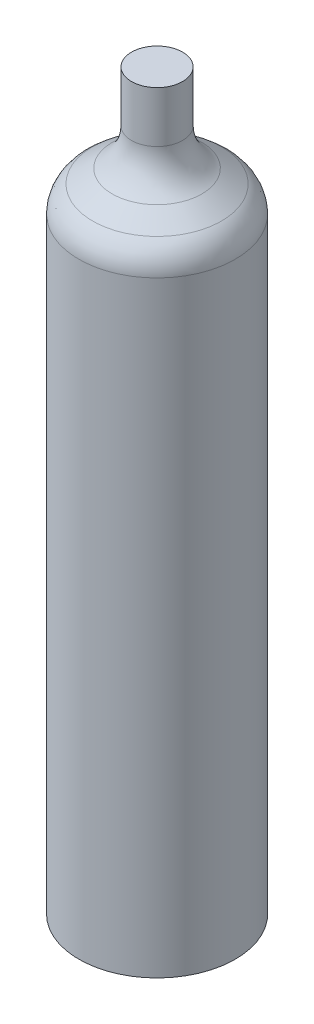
ISO-10303-21;
HEADER;
FILE_DESCRIPTION(('STEP AP214'),'2;1');
FILE_NAME('part.step','',(''),(''),'','','');
FILE_SCHEMA(('AUTOMOTIVE_DESIGN { 1 0 10303 214 1 1 1 1 }'));
ENDSEC;
DATA;
#1=APPLICATION_CONTEXT('core data for automotive mechanical design processes');
#2=APPLICATION_PROTOCOL_DEFINITION('international standard','automotive_design',2000,#1);
#3=PRODUCT_CONTEXT('',#1,'mechanical');
#4=PRODUCT('Part','Part','',(#3));
#5=PRODUCT_RELATED_PRODUCT_CATEGORY('part','',(#4));
#6=PRODUCT_DEFINITION_FORMATION('','',#4);
#7=PRODUCT_DEFINITION_CONTEXT('part definition',#1,'design');
#8=PRODUCT_DEFINITION('design','',#6,#7);
#9=PRODUCT_DEFINITION_SHAPE('','',#8);
#10=(LENGTH_UNIT() NAMED_UNIT(*) SI_UNIT(.MILLI.,.METRE.));
#11=(NAMED_UNIT(*) PLANE_ANGLE_UNIT() SI_UNIT($,.RADIAN.));
#12=(NAMED_UNIT(*) SI_UNIT($,.STERADIAN.) SOLID_ANGLE_UNIT());
#13=UNCERTAINTY_MEASURE_WITH_UNIT(LENGTH_MEASURE(1.E-05),#10,'distance_accuracy_value','');
#14=(GEOMETRIC_REPRESENTATION_CONTEXT(3) GLOBAL_UNCERTAINTY_ASSIGNED_CONTEXT((#13)) GLOBAL_UNIT_ASSIGNED_CONTEXT((#10,
#11,#12)) REPRESENTATION_CONTEXT('',''));
#15=CARTESIAN_POINT('',(0.,0.,0.));
#16=DIRECTION('',(0.,0.,1.));
#17=DIRECTION('',(1.,0.,0.));
#18=AXIS2_PLACEMENT_3D('',#15,#16,#17);
#19=CARTESIAN_POINT('',(1.22392290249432,118.171042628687,0.));
#20=DIRECTION('',(0.,-1.,0.));
#21=DIRECTION('',(0.,0.,-1.));
#22=AXIS2_PLACEMENT_3D('',#19,#20,#21);
#23=TOROIDAL_SURFACE('',#22,27.4979112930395,17.4979112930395);
#24=CARTESIAN_POINT('',(1.22392290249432,118.171042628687,0.));
#25=DIRECTION('',(0.,-1.,0.));
#26=DIRECTION('',(0.,0.,-1.));
#27=AXIS2_PLACEMENT_3D('',#24,#25,#26);
#28=CIRCLE('',#27,9.99999999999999);
#29=CARTESIAN_POINT('',(1.22392290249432,118.171042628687,-9.99999999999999));
#30=VERTEX_POINT('',#29);
#31=EDGE_CURVE('E10',#30,#30,#28,.T.);
#32=ORIENTED_EDGE('',*,*,#31,.T.);
#33=EDGE_LOOP('',(#32));
#34=FACE_BOUND('',#33,.T.);
#35=CARTESIAN_POINT('',(1.22392290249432,103.781168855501,0.));
#36=DIRECTION('',(0.,-1.,0.));
#37=DIRECTION('',(0.,0.,-1.));
#38=AXIS2_PLACEMENT_3D('',#35,#36,#37);
#39=CIRCLE('',#38,17.5425894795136);
#40=CARTESIAN_POINT('',(1.22392290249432,103.781168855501,-17.5425894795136));
#41=VERTEX_POINT('',#40);
#42=EDGE_CURVE('E57',#41,#41,#39,.T.);
#43=ORIENTED_EDGE('',*,*,#42,.F.);
#44=EDGE_LOOP('',(#43));
#45=FACE_BOUND('',#44,.T.);
#46=ADVANCED_FACE('F35',(#34,#45),#23,.F.);
#47=CARTESIAN_POINT('',(1.22392290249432,-151.865578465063,0.));
#48=DIRECTION('',(0.,-1.,0.));
#49=DIRECTION('',(0.,0.,-1.));
#50=AXIS2_PLACEMENT_3D('',#47,#48,#49);
#51=CYLINDRICAL_SURFACE('',#50,9.99999999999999);
#52=CARTESIAN_POINT('',(1.22392290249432,138.171042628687,0.));
#53=DIRECTION('',(0.,-1.,0.));
#54=DIRECTION('',(0.,0.,-1.));
#55=AXIS2_PLACEMENT_3D('',#52,#53,#54);
#56=CIRCLE('',#55,9.99999999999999);
#57=CARTESIAN_POINT('',(1.22392290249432,138.171042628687,-9.99999999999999));
#58=VERTEX_POINT('',#57);
#59=EDGE_CURVE('E41',#58,#58,#56,.T.);
#60=ORIENTED_EDGE('',*,*,#59,.T.);
#61=EDGE_LOOP('',(#60));
#62=FACE_BOUND('',#61,.T.);
#63=ORIENTED_EDGE('',*,*,#31,.F.);
#64=EDGE_LOOP('',(#63));
#65=FACE_BOUND('',#64,.T.);
#66=ADVANCED_FACE('F65',(#62,#65),#51,.T.);
#67=CARTESIAN_POINT('',(1.22392290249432,138.171042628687,0.));
#68=DIRECTION('',(0.,1.,0.));
#69=DIRECTION('',(0.,0.,1.));
#70=AXIS2_PLACEMENT_3D('',#67,#68,#69);
#71=PLANE('',#70);
#72=ORIENTED_EDGE('',*,*,#59,.F.);
#73=EDGE_LOOP('',(#72));
#74=FACE_BOUND('',#73,.T.);
#75=ADVANCED_FACE('F69',(#74),#71,.T.);
#76=CARTESIAN_POINT('',(31.8611299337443,-149.365578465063,0.));
#77=DIRECTION('',(0.,-1.,0.));
#78=DIRECTION('',(0.,0.,-1.));
#79=AXIS2_PLACEMENT_3D('',#76,#77,#78);
#80=PLANE('',#79);
#81=CARTESIAN_POINT('',(1.22392290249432,-149.365578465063,0.));
#82=DIRECTION('',(0.,-1.,0.));
#83=DIRECTION('',(0.,0.,-1.));
#84=AXIS2_PLACEMENT_3D('',#81,#82,#83);
#85=CIRCLE('',#84,30.63720703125);
#86=CARTESIAN_POINT('',(1.22392290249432,-149.365578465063,-30.63720703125));
#87=VERTEX_POINT('',#86);
#88=EDGE_CURVE('E45',#87,#87,#85,.T.);
#89=ORIENTED_EDGE('',*,*,#88,.T.);
#90=EDGE_LOOP('',(#89));
#91=FACE_BOUND('',#90,.T.);
#92=ADVANCED_FACE('F73',(#91),#80,.T.);
#93=CARTESIAN_POINT('',(1.22392290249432,-151.865578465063,0.));
#94=DIRECTION('',(0.,-1.,0.));
#95=DIRECTION('',(0.,0.,-1.));
#96=AXIS2_PLACEMENT_3D('',#93,#94,#95);
#97=CYLINDRICAL_SURFACE('',#96,30.63720703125);
#98=CARTESIAN_POINT('',(1.22392290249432,88.171042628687,0.));
#99=DIRECTION('',(0.,-1.,0.));
#100=DIRECTION('',(0.,0.,-1.));
#101=AXIS2_PLACEMENT_3D('',#98,#99,#100);
#102=CIRCLE('',#101,30.63720703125);
#103=CARTESIAN_POINT('',(1.22392290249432,88.171042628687,-30.63720703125));
#104=VERTEX_POINT('',#103);
#105=EDGE_CURVE('E49',#104,#104,#102,.T.);
#106=ORIENTED_EDGE('',*,*,#105,.T.);
#107=EDGE_LOOP('',(#106));
#108=FACE_BOUND('',#107,.T.);
#109=ORIENTED_EDGE('',*,*,#88,.F.);
#110=EDGE_LOOP('',(#109));
#111=FACE_BOUND('',#110,.T.);
#112=ADVANCED_FACE('F80',(#108,#111),#97,.T.);
#113=CARTESIAN_POINT('',(1.22392290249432,88.171042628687,0.));
#114=DIRECTION('',(0.,-1.,0.));
#115=DIRECTION('',(0.,0.,-1.));
#116=AXIS2_PLACEMENT_3D('',#113,#114,#115);
#117=TOROIDAL_SURFACE('',#116,18.1392957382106,12.4979112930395);
#118=CARTESIAN_POINT('',(1.22392290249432,98.4490331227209,0.));
#119=DIRECTION('',(0.,-1.,0.));
#120=DIRECTION('',(0.,0.,-1.));
#121=AXIS2_PLACEMENT_3D('',#118,#119,#120);
#122=CIRCLE('',#121,25.2499003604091);
#123=CARTESIAN_POINT('',(1.22392290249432,98.4490331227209,-25.2499003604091));
#124=VERTEX_POINT('',#123);
#125=EDGE_CURVE('E54',#124,#124,#122,.T.);
#126=ORIENTED_EDGE('',*,*,#125,.T.);
#127=EDGE_LOOP('',(#126));
#128=FACE_BOUND('',#127,.T.);
#129=ORIENTED_EDGE('',*,*,#105,.F.);
#130=EDGE_LOOP('',(#129));
#131=FACE_BOUND('',#130,.T.);
#132=ADVANCED_FACE('F84',(#128,#131),#117,.T.);
#133=CARTESIAN_POINT('',(1.22392290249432,98.4490331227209,0.));
#134=DIRECTION('',(0.,-1.,0.));
#135=DIRECTION('',(0.,0.,-1.));
#136=AXIS2_PLACEMENT_3D('',#133,#134,#135);
#137=CONICAL_SURFACE('',#136,25.2499003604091,0.965575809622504);
#138=ORIENTED_EDGE('',*,*,#42,.T.);
#139=EDGE_LOOP('',(#138));
#140=FACE_BOUND('',#139,.T.);
#141=ORIENTED_EDGE('',*,*,#125,.F.);
#142=EDGE_LOOP('',(#141));
#143=FACE_BOUND('',#142,.T.);
#144=ADVANCED_FACE('F61',(#140,#143),#137,.T.);
#145=CLOSED_SHELL('',(#46,#66,#75,#92,#112,#132,#144));
#146=MANIFOLD_SOLID_BREP('B2',#145);
#147=ADVANCED_BREP_SHAPE_REPRESENTATION('',(#18,#146),#14);
#148=SHAPE_DEFINITION_REPRESENTATION(#9,#147);
ENDSEC;
END-ISO-10303-21;
